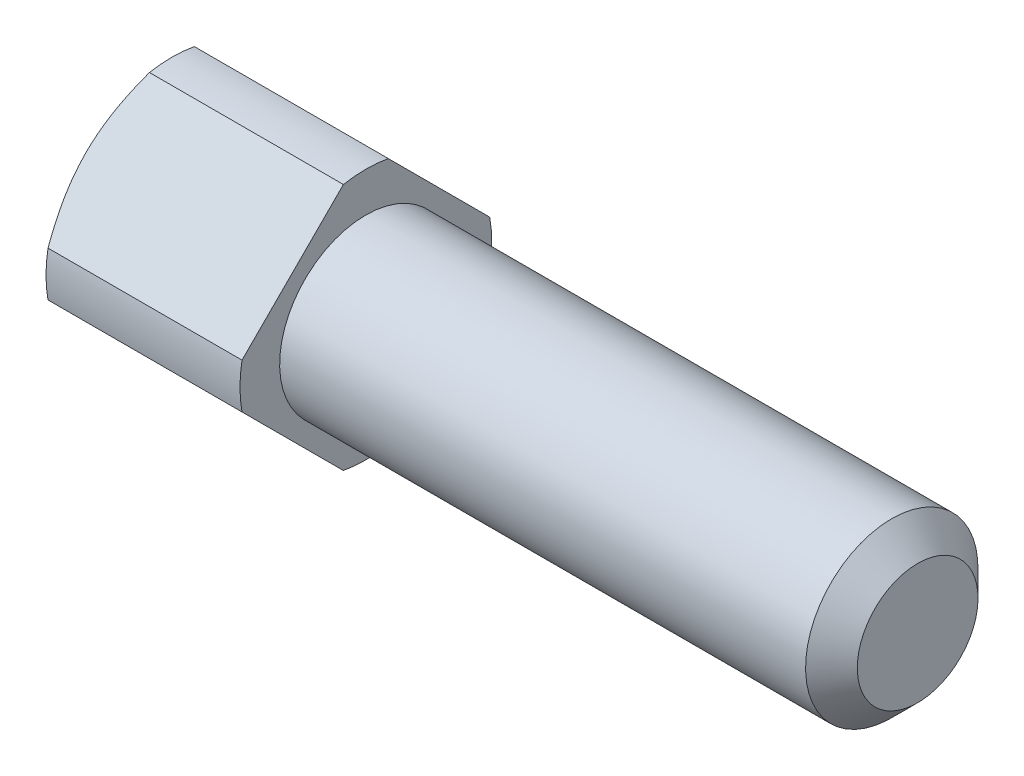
from build123d import *

# Parameters (mm, degrees)
SKETCH1_R          = 3.65
BASEHEAD_DEPTH     = 6
SKETCH2_OUTSIDE_W  = 11.688
SKETCH2_OUTSIDE_H  = 11.688
CUT_EXTRUDE1_DEPTH = 6


with BuildPart() as part:
    # Sketch1 → BaseHead (new body)
    with BuildSketch(Plane(origin=(0, 0, 0), x_dir=(0, 0, -1), z_dir=(1, 0, 0))):
        Circle(SKETCH1_R)
    extrude(amount=BASEHEAD_DEPTH)

    # Sketch2 outside → Cut-Extrude1 (cut)
    with BuildSketch(Plane(origin=(0, 1.683051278, -0.120507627), x_dir=(0, 0, 1), z_dir=(-1, 0, 0))):
        with Locations((0.121, -1.683)):
            Rectangle(SKETCH2_OUTSIDE_W, SKETCH2_OUTSIDE_H)
        Polygon((4.363148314, -1.683051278), (0.120507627, 2.559589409), (-4.12213306, -1.683051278), (0.120507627, -5.925691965), align=None, mode=Mode.SUBTRACT)
    extrude(amount=-CUT_EXTRUDE1_DEPTH, mode=Mode.SUBTRACT)

    # Sketch3 → Cut-Revolve1 (revolve, cut)
    with BuildSketch(Plane(origin=(1.259716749, -5.274716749, 0), x_dir=(0, -1, 0), z_dir=(0, 0, 1))):
        Polygon((-9.289716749, -1.259716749), (-8.274716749, -1.259716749), (-9.289716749, -0.673706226), align=None)
    revolve(axis=Axis((1.545283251, 0, 0), (-1, 0, 0)), mode=Mode.SUBTRACT)

    # Sketch4 → BaseBody (revolve)
    with BuildSketch(Plane(origin=(-10.34721472, 12.84721472, 0), x_dir=(0, -1, 0), z_dir=(0, 0, 1)), mode=Mode.PRIVATE) as basebody_sk:
        Polygon((12.84721472, 16.34721472), (15.34721472, 16.34721472), (15.34721472, 31.59721472), (14.59721472, 32.34721472), (12.84721472, 32.34721472), align=None)
    revolve(basebody_sk.sketch.rotate(Axis((14.086803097, 0, 0), (-1, 0, 0)), 180), axis=Axis((14.086803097, 0, 0), (-1, 0, 0)))


solid = part.part
